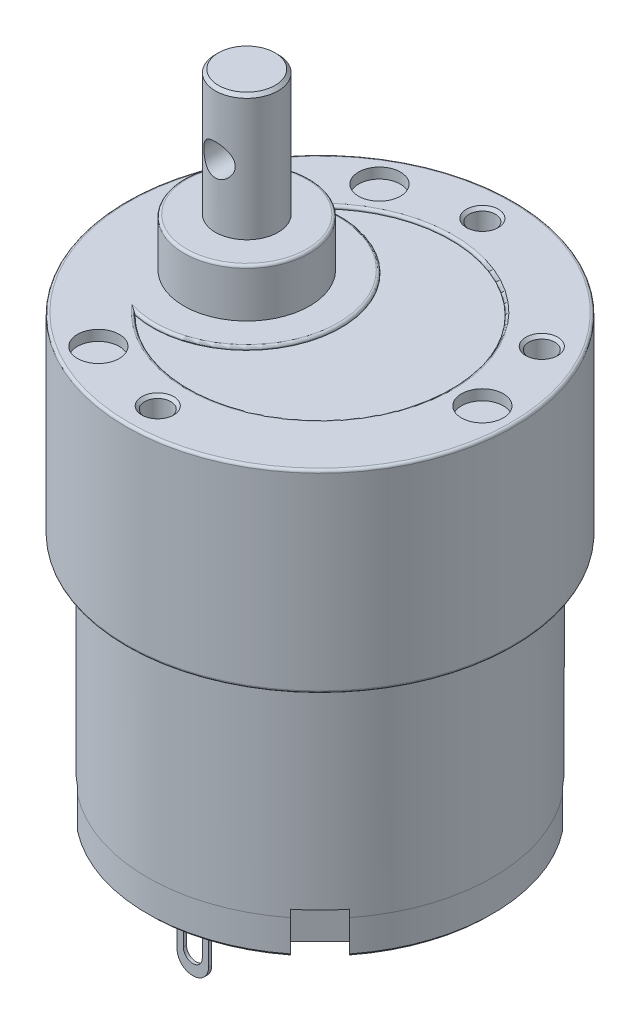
from build123d import *

# Parameters (mm, degrees)
SKETCH2_R                      = 18.5
BOSS_EXTRUDE1_DEPTH            = 18.5
SKETCH3_R                      = 16.5
BOSS_EXTRUDE2_DEPTH            = 20
SKETCH4_R                      = 16.5
BOSS_EXTRUDE3_DEPTH            = 3.3
SKETCH5_R                      = 6
BOSS_EXTRUDE4_DEPTH            = 4.6
SKETCH6_R                      = 3
BOSS_EXTRUDE5_DEPTH            = 12
SKETCH7_W                      = 3
SKETCH7_H                      = 0.3
BOSS_EXTRUDE6_DEPTH            = 7
FILLET1_R                      = 1.45
CUT_EXTRUDE1_REACH             = 62.524
SKETCH9_R                      = 3.5
BOSS_EXTRUDE7_DEPTH            = 3
CUT_EXTRUDE2_DEPTH             = 0.3
SKETCH11_R                     = 2
CUT_EXTRUDE3_DEPTH             = 1
M3X0_5_TAPPED_HOLE2_AT_2_COUNT = 2
M3X0_5_TAPPED_HOLE2_AT_2_PITCH = 15.5
M3X0_5_TAPPED_HOLE2_AT_3_COUNT = 2
M3X0_5_TAPPED_HOLE2_AT_3_PITCH = 31
M3X0_5_TAPPED_HOLE2_AT_4_COUNT = 2
M3X0_5_TAPPED_HOLE2_AT_4_PITCH = 15.5
CUT_EXTRUDE4_DEPTH             = 56.370931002
CUT_EXTRUDE4_DEPTH_BACK        = 56.370931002
SKETCH17_R                     = 1.5
CHAMFER1_SIZE                  = 0.3
FILLET2_R                      = 0.25
CHAMFER2_SIZE                  = 0.3
CUT_EXTRUDE5_DEPTH             = 4


with BuildPart() as part:
    # Sketch2 → Boss-Extrude1 (new body)
    with BuildSketch(Plane(origin=(0, 0, 0), x_dir=(1, 0, 0), z_dir=(0, 1, 0))):
        with Locations(Location((0, 0, 0), (0, 0, 270))):
            Circle(SKETCH2_R)
    extrude(amount=-BOSS_EXTRUDE1_DEPTH)

    # Sketch3 → Boss-Extrude2 (add)
    with BuildSketch(Plane.XZ.offset(18.5)):
        with Locations(Location((0, 0, 0), (0, 0, 270))):
            Circle(SKETCH3_R)
    extrude(amount=BOSS_EXTRUDE2_DEPTH)

    # Sketch5 → Boss-Extrude4 (add)
    with BuildSketch(Plane(origin=(0, 0, 0), x_dir=(1, 0, 0), z_dir=(0, 1, 0))):
        with Locations(Location((-7, 0, 0), (0, 0, 270))):
            Circle(SKETCH5_R)
    extrude(amount=BOSS_EXTRUDE4_DEPTH)

    # Sketch6 → Boss-Extrude5 (add)
    with BuildSketch(Plane(origin=(0, 4.6, 0), x_dir=(1, 0, 0), z_dir=(0, 1, 0))):
        with Locations(Location((-7, 0, 0), (0, 0, 270))):
            Circle(SKETCH6_R)
    extrude(amount=BOSS_EXTRUDE5_DEPTH)

    # Sketch10 → Cut-Extrude2 (cut)
    with BuildSketch(Plane(origin=(0, 0, 0), x_dir=(1, 0, 0), z_dir=(0, 1, 0))):
        with BuildLine():
            ThreePointArc((-8.875, -8.802520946), (12.5, 0), (-8.875, 8.802520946))
            ThreePointArc((-8.875, 8.802520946), (2, 0), (-8.875, -8.802520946))
        make_face()
    extrude(amount=-CUT_EXTRUDE2_DEPTH, mode=Mode.SUBTRACT)

    # Sketch11 → Cut-Extrude3 (cut)
    with BuildSketch(Plane(origin=(0, 0, 0), x_dir=(1, 0, 0), z_dir=(0, 1, 0))):
        with Locations(Location((15.5, 0, 0), (0, 0, 270))):
            Circle(SKETCH11_R)
        with Locations(Location((-7.75, -13.423393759, 0), (0, 0, 270))):
            Circle(SKETCH11_R)
        with Locations(Location((-7.75, 13.423393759, 0), (0, 0, 270))):
            Circle(SKETCH11_R)
    extrude(amount=-CUT_EXTRUDE3_DEPTH, mode=Mode.SUBTRACT)

    # Sketch16 → M3x0.5 Tapped Hole2 (revolve, cut)
    with BuildSketch(Plane(origin=(0, 0, -15.5), x_dir=(0, 0, 1), z_dir=(1, 0, 0))):
        Polygon((0, 0), (0, 17.751075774), (1.25, 17), (1.25, 0.275), (1.525, 0), align=None)
    m3x0_5_tapped_hole2 = revolve(axis=Axis((0, 6.35, -15.5), (0, -1, 0)), mode=Mode.SUBTRACT)

    # M3x0.5 Tapped Hole2 at 2: M3x0.5 Tapped Hole2 ×2
    with Locations(*[Vector(-0.8660254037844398, 0, 0.499999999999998) * (i * M3X0_5_TAPPED_HOLE2_AT_2_PITCH) for i in range(1, M3X0_5_TAPPED_HOLE2_AT_2_COUNT)]):
        add(m3x0_5_tapped_hole2, mode=Mode.SUBTRACT)

    # M3x0.5 Tapped Hole2 at 3: M3x0.5 Tapped Hole2 ×2
    with Locations(*[(0, 0, i * M3X0_5_TAPPED_HOLE2_AT_3_PITCH) for i in range(1, M3X0_5_TAPPED_HOLE2_AT_3_COUNT)]):
        add(m3x0_5_tapped_hole2, mode=Mode.SUBTRACT)

    # M3x0.5 Tapped Hole2 at 4: M3x0.5 Tapped Hole2 ×2
    with Locations(*[Vector(0.8660254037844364, 0, 0.5000000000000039) * (i * M3X0_5_TAPPED_HOLE2_AT_4_PITCH) for i in range(1, M3X0_5_TAPPED_HOLE2_AT_4_COUNT)]):
        add(m3x0_5_tapped_hole2, mode=Mode.SUBTRACT)

    # Sketch17 → Cut-Extrude4 (cut, two sides: drawn at the far end of the back side and taken through both)
    with BuildSketch(Plane.XY.offset(-CUT_EXTRUDE4_DEPTH_BACK)):
        with Locations(Location((-7, 10.6, 0), (0, 0, 90.00000001))):
            Circle(SKETCH17_R)
    extrude(amount=CUT_EXTRUDE4_DEPTH + CUT_EXTRUDE4_DEPTH_BACK, mode=Mode.SUBTRACT)

    # Chamfer1
    chamfer1_edges = [part.edges().sort_by_distance(p)[0] for p in [
        (-7, 16.6, -3),
    ]]
    chamfer(chamfer1_edges, length=CHAMFER1_SIZE)

    # Fillet2
    fillet2_edges = [part.edges().sort_by_distance(p)[0] for p in [
        (-7, 4.6, -6),
        (0, 0, -18.5),
        (2, 0, 0),
        (12.5, 0, 0),
        (0, -18.5, -18.5),
    ]]
    fillet(fillet2_edges, radius=FILLET2_R)


with BuildPart() as body_2:
    # Sketch4 → Boss-Extrude3 (new body)
    with BuildSketch(Plane.XZ.offset(38.5)):
        with Locations(Location((0, 0, 0), (0, 0, 270))):
            Circle(SKETCH4_R)
    extrude(amount=BOSS_EXTRUDE3_DEPTH)

    # Sketch7 → Boss-Extrude6 (add)
    with BuildSketch(Plane.XZ.offset(41.8)):
        with Locations((0, 12)):
            Rectangle(SKETCH7_W, SKETCH7_H)
        with Locations((0, -12)):
            Rectangle(SKETCH7_W, SKETCH7_H)
    extrude(amount=BOSS_EXTRUDE6_DEPTH)

    # Fillet1
    fillet1_edges = [body_2.edges().sort_by_distance(p)[0] for p in [
        (-1.5, -48.8, 12),
        (-1.5, -48.8, -12),
        (1.5, -48.8, -12),
        (1.5, -48.8, 12),
    ]]
    fillet(fillet1_edges, radius=FILLET1_R)

    # Cut-Extrude1: up to this face of the body (flat: up to its plane)
    cut_extrude1_end = Plane(body_2.part.faces().sort_by_distance((0, -45.157389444, -12.15))[0])
    # Sketch8 → Cut-Extrude1 (cut, up to the picked face)
    with BuildSketch(Plane.XY.offset(12.15), mode=Mode.PRIVATE) as cut_extrude1_sk1:
        with BuildLine():
            Line((-0.9, -46.9), (-0.9, -44.9))
            ThreePointArc((-0.9, -44.9), (0, -44), (0.9, -44.9))
            Line((0.9, -44.9), (0.9, -46.9))
            ThreePointArc((0.9, -46.9), (0, -47.8), (-0.9, -46.9))
        make_face()
    cut_extrude1_tool1 = split(extrude(cut_extrude1_sk1.sketch, amount=-CUT_EXTRUDE1_REACH, mode=Mode.PRIVATE), bisect_by=cut_extrude1_end, keep=Keep.BOTH, mode=Mode.PRIVATE)
    add(cut_extrude1_tool1.solids().sort_by(Axis((0, -45.9, 12.15), (0, 0, -1)))[0], mode=Mode.SUBTRACT)

    # Sketch9 → Boss-Extrude7 (add)
    with BuildSketch(Plane.XZ.offset(41.8)):
        with Locations(Location((0, 0, 0), (0, 0, 270))):
            Circle(SKETCH9_R)
    extrude(amount=BOSS_EXTRUDE7_DEPTH)

    # Chamfer2
    chamfer2_edges = [body_2.edges().sort_by_distance(p)[0] for p in [
        (0, -41.8, 16.5),
    ]]
    chamfer(chamfer2_edges, length=CHAMFER2_SIZE)


with BuildPart() as cut_extrude5_tool:
    # Sketch18 → Cut-Extrude5 (new body)
    with BuildSketch(Plane.XZ.offset(41.8)):
        Polygon((8.838834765, 11.66726189), (11.66726189, 8.838834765), (14.495689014, 11.66726189), (11.66726189, 14.495689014), align=None)
        Polygon((14.495689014, -11.66726189), (11.66726189, -8.838834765), (8.838834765, -11.66726189), (11.66726189, -14.495689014), align=None)
        Polygon((-11.66726189, -14.495689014), (-8.838834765, -11.66726189), (-11.66726189, -8.838834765), (-14.495689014, -11.66726189), align=None)
        Polygon((-14.495689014, 11.66726189), (-11.66726189, 8.838834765), (-8.838834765, 11.66726189), (-11.66726189, 14.495689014), align=None)
    extrude(amount=-CUT_EXTRUDE5_DEPTH)


with BuildPart() as part_1:
    add(part.part)

    # Cut-Extrude5: cut by cut_extrude5_tool
    add(cut_extrude5_tool.part, mode=Mode.SUBTRACT)


with BuildPart() as body_2_1:
    add(body_2.part)

    # Cut-Extrude5: cut by cut_extrude5_tool
    add(cut_extrude5_tool.part, mode=Mode.SUBTRACT)


solid = Compound([part_1.part, body_2_1.part])
